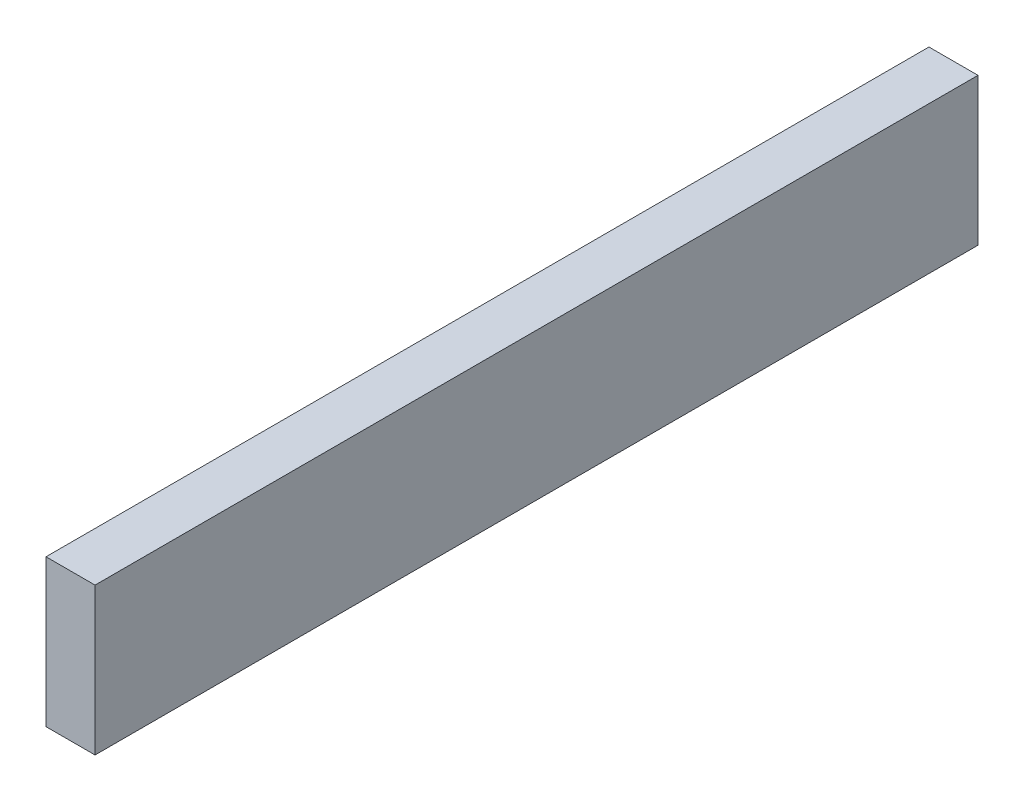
ISO-10303-21;
HEADER;
FILE_DESCRIPTION(('STEP AP214'),'2;1');
FILE_NAME('part.step','',(''),(''),'','','');
FILE_SCHEMA(('AUTOMOTIVE_DESIGN { 1 0 10303 214 1 1 1 1 }'));
ENDSEC;
DATA;
#1=APPLICATION_CONTEXT('core data for automotive mechanical design processes');
#2=APPLICATION_PROTOCOL_DEFINITION('international standard','automotive_design',2000,#1);
#3=PRODUCT_CONTEXT('',#1,'mechanical');
#4=PRODUCT('Part','Part','',(#3));
#5=PRODUCT_RELATED_PRODUCT_CATEGORY('part','',(#4));
#6=PRODUCT_DEFINITION_FORMATION('','',#4);
#7=PRODUCT_DEFINITION_CONTEXT('part definition',#1,'design');
#8=PRODUCT_DEFINITION('design','',#6,#7);
#9=PRODUCT_DEFINITION_SHAPE('','',#8);
#10=(LENGTH_UNIT() NAMED_UNIT(*) SI_UNIT(.MILLI.,.METRE.));
#11=(NAMED_UNIT(*) PLANE_ANGLE_UNIT() SI_UNIT($,.RADIAN.));
#12=(NAMED_UNIT(*) SI_UNIT($,.STERADIAN.) SOLID_ANGLE_UNIT());
#13=UNCERTAINTY_MEASURE_WITH_UNIT(LENGTH_MEASURE(1.E-05),#10,'distance_accuracy_value','');
#14=(GEOMETRIC_REPRESENTATION_CONTEXT(3) GLOBAL_UNCERTAINTY_ASSIGNED_CONTEXT((#13)) GLOBAL_UNIT_ASSIGNED_CONTEXT((#10,
#11,#12)) REPRESENTATION_CONTEXT('',''));
#15=CARTESIAN_POINT('',(0.,0.,0.));
#16=DIRECTION('',(0.,0.,1.));
#17=DIRECTION('',(1.,0.,0.));
#18=AXIS2_PLACEMENT_3D('',#15,#16,#17);
#19=CARTESIAN_POINT('',(-50.,2.22044604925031E-13,900.));
#20=DIRECTION('',(0.,-1.,0.));
#21=DIRECTION('',(0.,0.,-1.));
#22=AXIS2_PLACEMENT_3D('',#19,#20,#21);
#23=PLANE('',#22);
#24=DIRECTION('',(1.,0.,0.));
#25=VECTOR('',#24,1.);
#26=CARTESIAN_POINT('',(-50.,2.22044604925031E-13,-900.));
#27=LINE('',#26,#25);
#28=CARTESIAN_POINT('',(-50.,2.22044604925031E-13,-900.));
#29=VERTEX_POINT('',#28);
#30=CARTESIAN_POINT('',(50.,2.22044604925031E-13,-900.));
#31=VERTEX_POINT('',#30);
#32=EDGE_CURVE('E48',#29,#31,#27,.T.);
#33=ORIENTED_EDGE('',*,*,#32,.T.);
#34=DIRECTION('',(0.,0.,-1.));
#35=VECTOR('',#34,1.);
#36=CARTESIAN_POINT('',(50.,2.22044604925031E-13,900.));
#37=LINE('',#36,#35);
#38=CARTESIAN_POINT('',(50.,2.22044604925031E-13,900.));
#39=VERTEX_POINT('',#38);
#40=EDGE_CURVE('E85',#39,#31,#37,.T.);
#41=ORIENTED_EDGE('',*,*,#40,.F.);
#42=DIRECTION('',(1.,0.,0.));
#43=VECTOR('',#42,1.);
#44=CARTESIAN_POINT('',(-50.,2.22044604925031E-13,900.));
#45=LINE('',#44,#43);
#46=CARTESIAN_POINT('',(-50.,2.22044604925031E-13,900.));
#47=VERTEX_POINT('',#46);
#48=EDGE_CURVE('E11',#47,#39,#45,.T.);
#49=ORIENTED_EDGE('',*,*,#48,.F.);
#50=DIRECTION('',(0.,0.,-1.));
#51=VECTOR('',#50,1.);
#52=CARTESIAN_POINT('',(-50.,2.22044604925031E-13,900.));
#53=LINE('',#52,#51);
#54=EDGE_CURVE('E86',#47,#29,#53,.T.);
#55=ORIENTED_EDGE('',*,*,#54,.T.);
#56=EDGE_LOOP('',(#33,#41,#49,#55));
#57=FACE_BOUND('',#56,.T.);
#58=ADVANCED_FACE('F45',(#57),#23,.T.);
#59=CARTESIAN_POINT('',(-50.,2.22044604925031E-13,900.));
#60=DIRECTION('',(0.,0.,1.));
#61=DIRECTION('',(1.,0.,0.));
#62=AXIS2_PLACEMENT_3D('',#59,#60,#61);
#63=PLANE('',#62);
#64=ORIENTED_EDGE('',*,*,#48,.T.);
#65=DIRECTION('',(0.,-1.,0.));
#66=VECTOR('',#65,1.);
#67=CARTESIAN_POINT('',(50.,2.22044604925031E-13,900.));
#68=LINE('',#67,#66);
#69=CARTESIAN_POINT('',(50.,300.,900.));
#70=VERTEX_POINT('',#69);
#71=EDGE_CURVE('E102',#70,#39,#68,.T.);
#72=ORIENTED_EDGE('',*,*,#71,.F.);
#73=DIRECTION('',(1.,0.,0.));
#74=VECTOR('',#73,1.);
#75=CARTESIAN_POINT('',(-50.,300.,900.));
#76=LINE('',#75,#74);
#77=CARTESIAN_POINT('',(-50.,300.,900.));
#78=VERTEX_POINT('',#77);
#79=EDGE_CURVE('E53',#78,#70,#76,.T.);
#80=ORIENTED_EDGE('',*,*,#79,.F.);
#81=DIRECTION('',(0.,-1.,0.));
#82=VECTOR('',#81,1.);
#83=CARTESIAN_POINT('',(-50.,2.22044604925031E-13,900.));
#84=LINE('',#83,#82);
#85=EDGE_CURVE('E91',#78,#47,#84,.T.);
#86=ORIENTED_EDGE('',*,*,#85,.T.);
#87=EDGE_LOOP('',(#64,#72,#80,#86));
#88=FACE_BOUND('',#87,.T.);
#89=ADVANCED_FACE('F122',(#88),#63,.T.);
#90=CARTESIAN_POINT('',(-50.,300.,900.));
#91=DIRECTION('',(0.,1.,0.));
#92=DIRECTION('',(0.,0.,1.));
#93=AXIS2_PLACEMENT_3D('',#90,#91,#92);
#94=PLANE('',#93);
#95=ORIENTED_EDGE('',*,*,#79,.T.);
#96=DIRECTION('',(0.,0.,1.));
#97=VECTOR('',#96,1.);
#98=CARTESIAN_POINT('',(50.,300.,900.));
#99=LINE('',#98,#97);
#100=CARTESIAN_POINT('',(50.,300.,-900.));
#101=VERTEX_POINT('',#100);
#102=EDGE_CURVE('E98',#101,#70,#99,.T.);
#103=ORIENTED_EDGE('',*,*,#102,.F.);
#104=DIRECTION('',(1.,0.,0.));
#105=VECTOR('',#104,1.);
#106=CARTESIAN_POINT('',(-50.,300.,-900.));
#107=LINE('',#106,#105);
#108=CARTESIAN_POINT('',(-50.,300.,-900.));
#109=VERTEX_POINT('',#108);
#110=EDGE_CURVE('E90',#109,#101,#107,.T.);
#111=ORIENTED_EDGE('',*,*,#110,.F.);
#112=DIRECTION('',(0.,0.,1.));
#113=VECTOR('',#112,1.);
#114=CARTESIAN_POINT('',(-50.,300.,900.));
#115=LINE('',#114,#113);
#116=EDGE_CURVE('E114',#109,#78,#115,.T.);
#117=ORIENTED_EDGE('',*,*,#116,.T.);
#118=EDGE_LOOP('',(#95,#103,#111,#117));
#119=FACE_BOUND('',#118,.T.);
#120=ADVANCED_FACE('F119',(#119),#94,.T.);
#121=CARTESIAN_POINT('',(-50.,2.22044604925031E-13,-900.));
#122=DIRECTION('',(0.,0.,-1.));
#123=DIRECTION('',(-1.,0.,0.));
#124=AXIS2_PLACEMENT_3D('',#121,#122,#123);
#125=PLANE('',#124);
#126=ORIENTED_EDGE('',*,*,#110,.T.);
#127=DIRECTION('',(0.,1.,0.));
#128=VECTOR('',#127,1.);
#129=CARTESIAN_POINT('',(50.,2.22044604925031E-13,-900.));
#130=LINE('',#129,#128);
#131=EDGE_CURVE('E93',#31,#101,#130,.T.);
#132=ORIENTED_EDGE('',*,*,#131,.F.);
#133=ORIENTED_EDGE('',*,*,#32,.F.);
#134=DIRECTION('',(0.,1.,0.));
#135=VECTOR('',#134,1.);
#136=CARTESIAN_POINT('',(-50.,2.22044604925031E-13,-900.));
#137=LINE('',#136,#135);
#138=EDGE_CURVE('E112',#29,#109,#137,.T.);
#139=ORIENTED_EDGE('',*,*,#138,.T.);
#140=EDGE_LOOP('',(#126,#132,#133,#139));
#141=FACE_BOUND('',#140,.T.);
#142=ADVANCED_FACE('F94',(#141),#125,.T.);
#143=CARTESIAN_POINT('',(-50.,0.,0.));
#144=DIRECTION('',(1.,0.,0.));
#145=DIRECTION('',(0.,0.,-1.));
#146=AXIS2_PLACEMENT_3D('',#143,#144,#145);
#147=PLANE('',#146);
#148=ORIENTED_EDGE('',*,*,#54,.F.);
#149=ORIENTED_EDGE('',*,*,#85,.F.);
#150=ORIENTED_EDGE('',*,*,#116,.F.);
#151=ORIENTED_EDGE('',*,*,#138,.F.);
#152=EDGE_LOOP('',(#148,#149,#150,#151));
#153=FACE_BOUND('',#152,.T.);
#154=ADVANCED_FACE('F124',(#153),#147,.F.);
#155=CARTESIAN_POINT('',(50.,0.,0.));
#156=DIRECTION('',(1.,0.,0.));
#157=DIRECTION('',(0.,0.,-1.));
#158=AXIS2_PLACEMENT_3D('',#155,#156,#157);
#159=PLANE('',#158);
#160=ORIENTED_EDGE('',*,*,#40,.T.);
#161=ORIENTED_EDGE('',*,*,#131,.T.);
#162=ORIENTED_EDGE('',*,*,#102,.T.);
#163=ORIENTED_EDGE('',*,*,#71,.T.);
#164=EDGE_LOOP('',(#160,#161,#162,#163));
#165=FACE_BOUND('',#164,.T.);
#166=ADVANCED_FACE('F101',(#165),#159,.T.);
#167=CLOSED_SHELL('',(#58,#89,#120,#142,#154,#166));
#168=MANIFOLD_SOLID_BREP('B2',#167);
#169=ADVANCED_BREP_SHAPE_REPRESENTATION('',(#18,#168),#14);
#170=SHAPE_DEFINITION_REPRESENTATION(#9,#169);
ENDSEC;
END-ISO-10303-21;
